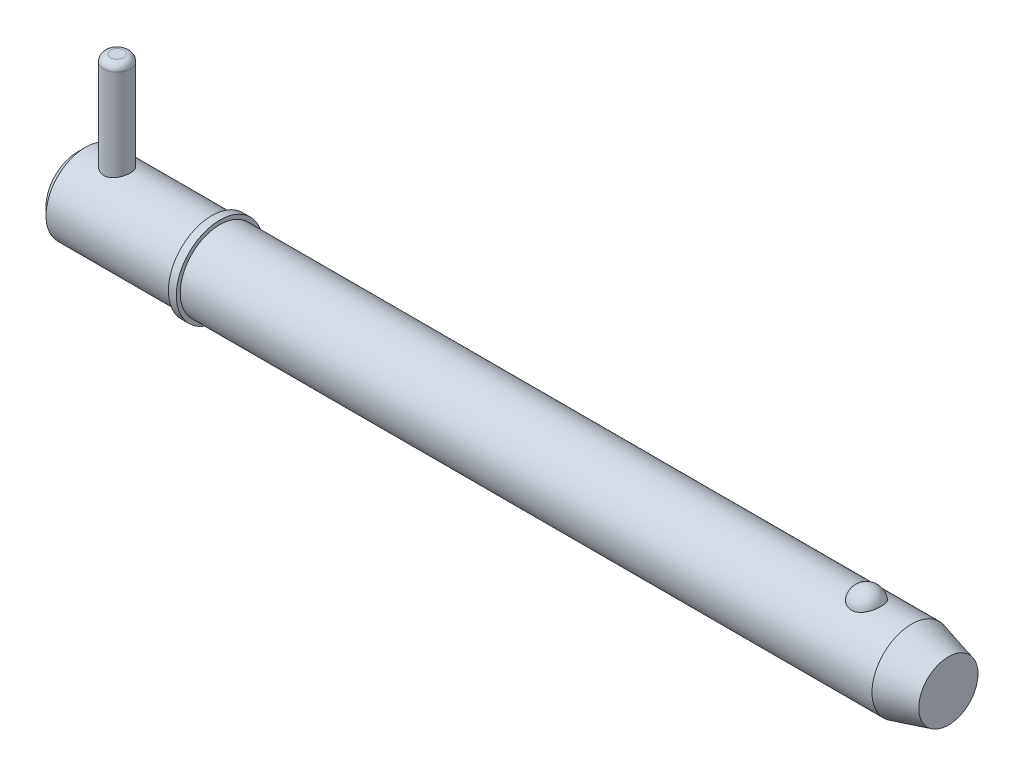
ISO-10303-21;
HEADER;
FILE_DESCRIPTION(('STEP AP214'),'2;1');
FILE_NAME('part.step','',(''),(''),'','','');
FILE_SCHEMA(('AUTOMOTIVE_DESIGN { 1 0 10303 214 1 1 1 1 }'));
ENDSEC;
DATA;
#1=APPLICATION_CONTEXT('core data for automotive mechanical design processes');
#2=APPLICATION_PROTOCOL_DEFINITION('international standard','automotive_design',2000,#1);
#3=PRODUCT_CONTEXT('',#1,'mechanical');
#4=PRODUCT('Part','Part','',(#3));
#5=PRODUCT_RELATED_PRODUCT_CATEGORY('part','',(#4));
#6=PRODUCT_DEFINITION_FORMATION('','',#4);
#7=PRODUCT_DEFINITION_CONTEXT('part definition',#1,'design');
#8=PRODUCT_DEFINITION('design','',#6,#7);
#9=PRODUCT_DEFINITION_SHAPE('','',#8);
#10=(LENGTH_UNIT() NAMED_UNIT(*) SI_UNIT(.MILLI.,.METRE.));
#11=(NAMED_UNIT(*) PLANE_ANGLE_UNIT() SI_UNIT($,.RADIAN.));
#12=(NAMED_UNIT(*) SI_UNIT($,.STERADIAN.) SOLID_ANGLE_UNIT());
#13=UNCERTAINTY_MEASURE_WITH_UNIT(LENGTH_MEASURE(1.E-05),#10,'distance_accuracy_value','');
#14=(GEOMETRIC_REPRESENTATION_CONTEXT(3) GLOBAL_UNCERTAINTY_ASSIGNED_CONTEXT((#13)) GLOBAL_UNIT_ASSIGNED_CONTEXT((#10,
#11,#12)) REPRESENTATION_CONTEXT('',''));
#15=CARTESIAN_POINT('',(0.,0.,0.));
#16=DIRECTION('',(0.,0.,1.));
#17=DIRECTION('',(1.,0.,0.));
#18=AXIS2_PLACEMENT_3D('',#15,#16,#17);
#19=CARTESIAN_POINT('',(7.14,24.605,0.));
#20=DIRECTION('',(0.,-1.,0.));
#21=DIRECTION('',(0.,0.,-1.));
#22=AXIS2_PLACEMENT_3D('',#19,#20,#21);
#23=CYLINDRICAL_SURFACE('',#22,2.38);
#24=CARTESIAN_POINT('',(7.14,-5.955,0.));
#25=DIRECTION('',(0.,1.,0.));
#26=DIRECTION('',(0.,0.,1.));
#27=AXIS2_PLACEMENT_3D('',#24,#25,#26);
#28=CIRCLE('',#27,2.38);
#29=CARTESIAN_POINT('',(7.14,-5.955,2.38));
#30=VERTEX_POINT('',#29);
#31=EDGE_CURVE('P0_E25',#30,#30,#28,.T.);
#32=ORIENTED_EDGE('',*,*,#31,.T.);
#33=EDGE_LOOP('',(#32));
#34=FACE_BOUND('',#33,.T.);
#35=CARTESIAN_POINT('',(7.14,23.415,0.));
#36=DIRECTION('',(0.,1.,0.));
#37=DIRECTION('',(0.,0.,1.));
#38=AXIS2_PLACEMENT_3D('',#35,#36,#37);
#39=CIRCLE('',#38,2.38);
#40=CARTESIAN_POINT('',(7.14,23.415,2.38));
#41=VERTEX_POINT('',#40);
#42=EDGE_CURVE('P0_E29',#41,#41,#39,.F.);
#43=ORIENTED_EDGE('',*,*,#42,.T.);
#44=EDGE_LOOP('',(#43));
#45=FACE_BOUND('',#44,.T.);
#46=ADVANCED_FACE('P0_F14',(#34,#45),#23,.T.);
#47=CARTESIAN_POINT('',(7.14,24.605,0.));
#48=DIRECTION('',(0.,1.,0.));
#49=DIRECTION('',(0.,0.,1.));
#50=AXIS2_PLACEMENT_3D('',#47,#48,#49);
#51=PLANE('',#50);
#52=CARTESIAN_POINT('',(7.14,24.605,0.));
#53=DIRECTION('',(0.,1.,0.));
#54=DIRECTION('',(0.,0.,1.));
#55=AXIS2_PLACEMENT_3D('',#52,#53,#54);
#56=CIRCLE('',#55,1.19);
#57=CARTESIAN_POINT('',(7.14,24.605,1.19));
#58=VERTEX_POINT('',#57);
#59=EDGE_CURVE('P0_E10',#58,#58,#56,.T.);
#60=ORIENTED_EDGE('',*,*,#59,.T.);
#61=EDGE_LOOP('',(#60));
#62=FACE_BOUND('',#61,.T.);
#63=ADVANCED_FACE('P0_F46',(#62),#51,.T.);
#64=CARTESIAN_POINT('',(7.14,-7.145,0.));
#65=DIRECTION('',(0.,1.,0.));
#66=DIRECTION('',(0.,0.,1.));
#67=AXIS2_PLACEMENT_3D('',#64,#65,#66);
#68=PLANE('',#67);
#69=CARTESIAN_POINT('',(7.14,-7.145,0.));
#70=DIRECTION('',(0.,1.,0.));
#71=DIRECTION('',(0.,0.,1.));
#72=AXIS2_PLACEMENT_3D('',#69,#70,#71);
#73=CIRCLE('',#72,1.19);
#74=CARTESIAN_POINT('',(7.14,-7.145,1.19));
#75=VERTEX_POINT('',#74);
#76=EDGE_CURVE('P0_E21',#75,#75,#73,.F.);
#77=ORIENTED_EDGE('',*,*,#76,.T.);
#78=EDGE_LOOP('',(#77));
#79=FACE_BOUND('',#78,.T.);
#80=ADVANCED_FACE('P0_F43',(#79),#68,.F.);
#81=CARTESIAN_POINT('',(7.14,-5.955,0.));
#82=DIRECTION('',(0.,1.,0.));
#83=DIRECTION('',(0.,0.,1.));
#84=AXIS2_PLACEMENT_3D('',#81,#82,#83);
#85=DEGENERATE_TOROIDAL_SURFACE('',#84,1.19,1.19,.T.);
#86=ORIENTED_EDGE('',*,*,#76,.F.);
#87=EDGE_LOOP('',(#86));
#88=FACE_BOUND('',#87,.T.);
#89=ORIENTED_EDGE('',*,*,#31,.F.);
#90=EDGE_LOOP('',(#89));
#91=FACE_BOUND('',#90,.T.);
#92=ADVANCED_FACE('P0_F38',(#88,#91),#85,.T.);
#93=CARTESIAN_POINT('',(7.14,23.415,0.));
#94=DIRECTION('',(0.,1.,0.));
#95=DIRECTION('',(0.,0.,1.));
#96=AXIS2_PLACEMENT_3D('',#93,#94,#95);
#97=DEGENERATE_TOROIDAL_SURFACE('',#96,1.19,1.19,.T.);
#98=ORIENTED_EDGE('',*,*,#42,.F.);
#99=EDGE_LOOP('',(#98));
#100=FACE_BOUND('',#99,.T.);
#101=ORIENTED_EDGE('',*,*,#59,.F.);
#102=EDGE_LOOP('',(#101));
#103=FACE_BOUND('',#102,.T.);
#104=ADVANCED_FACE('P0_F16',(#100,#103),#97,.T.);
#105=CLOSED_SHELL('',(#46,#63,#80,#92,#104));
#106=MANIFOLD_SOLID_BREP('P0_B1',#105);
#107=CARTESIAN_POINT('',(0.,0.,0.));
#108=DIRECTION('',(1.,0.,0.));
#109=DIRECTION('',(0.,0.,-1.));
#110=AXIS2_PLACEMENT_3D('',#107,#108,#109);
#111=CYLINDRICAL_SURFACE('',#110,7.145);
#112=CARTESIAN_POINT('',(150.78362424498,0.,0.));
#113=DIRECTION('',(1.,0.,0.));
#114=DIRECTION('',(0.,0.,-1.));
#115=AXIS2_PLACEMENT_3D('',#112,#113,#114);
#116=CIRCLE('',#115,7.145);
#117=CARTESIAN_POINT('',(150.78362424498,0.,-7.145));
#118=VERTEX_POINT('',#117);
#119=EDGE_CURVE('P1_E81',#118,#118,#116,.T.);
#120=ORIENTED_EDGE('',*,*,#119,.F.);
#121=EDGE_LOOP('',(#120));
#122=FACE_BOUND('',#121,.T.);
#123=CARTESIAN_POINT('',(25.7,0.,0.));
#124=DIRECTION('',(1.,0.,0.));
#125=DIRECTION('',(0.,0.,-1.));
#126=AXIS2_PLACEMENT_3D('',#123,#124,#125);
#127=CIRCLE('',#126,7.145);
#128=CARTESIAN_POINT('',(25.7,0.,-7.145));
#129=VERTEX_POINT('',#128);
#130=EDGE_CURVE('P1_E85',#129,#129,#127,.T.);
#131=ORIENTED_EDGE('',*,*,#130,.T.);
#132=EDGE_LOOP('',(#131));
#133=FACE_BOUND('',#132,.T.);
#134=CARTESIAN_POINT('',(142.639503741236,6.60328629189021,2.72903557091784));
#135=CARTESIAN_POINT('',(142.498315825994,6.60329644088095,2.7290249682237));
#136=CARTESIAN_POINT('',(142.356883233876,6.60799490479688,2.71772840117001));
#137=CARTESIAN_POINT('',(142.077955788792,6.62628236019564,2.6728193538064));
#138=CARTESIAN_POINT('',(141.940472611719,6.63989534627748,2.63914664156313));
#139=CARTESIAN_POINT('',(141.673889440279,6.67440775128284,2.55059642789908));
#140=CARTESIAN_POINT('',(141.544768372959,6.69528793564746,2.49577486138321));
#141=CARTESIAN_POINT('',(141.297869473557,6.74205585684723,2.36651799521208));
#142=CARTESIAN_POINT('',(141.180086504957,6.76794130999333,2.2920916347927));
#143=CARTESIAN_POINT('',(140.95516710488,6.82286177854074,2.12312937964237));
#144=CARTESIAN_POINT('',(140.848440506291,6.85196655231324,2.0280710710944));
#145=CARTESIAN_POINT('',(140.651918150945,6.90970232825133,1.82167822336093));
#146=CARTESIAN_POINT('',(140.562127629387,6.93833318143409,1.71033867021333));
#147=CARTESIAN_POINT('',(140.397667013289,6.9935167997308,1.46891951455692));
#148=CARTESIAN_POINT('',(140.323844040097,7.01992110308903,1.33822781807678));
#149=CARTESIAN_POINT('',(140.198088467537,7.06643385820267,1.06566567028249));
#150=CARTESIAN_POINT('',(140.14615735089,7.08654188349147,0.923794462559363));
#151=CARTESIAN_POINT('',(140.064732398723,7.11862399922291,0.630993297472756));
#152=CARTESIAN_POINT('',(140.035516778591,7.13049704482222,0.479974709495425));
#153=CARTESIAN_POINT('',(140.001174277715,7.14449484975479,0.174782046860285));
#154=CARTESIAN_POINT('',(139.996046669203,7.14661990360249,0.020608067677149));
#155=CARTESIAN_POINT('',(140.009938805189,7.14092465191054,-0.285506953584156));
#156=CARTESIAN_POINT('',(140.028810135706,7.1331654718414,-0.437455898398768));
#157=CARTESIAN_POINT('',(140.090062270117,7.10859076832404,-0.73577860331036));
#158=CARTESIAN_POINT('',(140.132443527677,7.0917750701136,-0.882152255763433));
#159=CARTESIAN_POINT('',(140.239934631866,7.05076716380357,-1.16543149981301));
#160=CARTESIAN_POINT('',(140.305075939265,7.02656475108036,-1.30232366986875));
#161=CARTESIAN_POINT('',(140.456759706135,6.97329145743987,-1.56265907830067));
#162=CARTESIAN_POINT('',(140.543303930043,6.94422017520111,-1.68610120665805));
#163=CARTESIAN_POINT('',(140.736465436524,6.88415108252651,-1.91671004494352));
#164=CARTESIAN_POINT('',(140.843180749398,6.85314438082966,-2.02379244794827));
#165=CARTESIAN_POINT('',(141.073974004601,6.79282069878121,-2.21787433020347));
#166=CARTESIAN_POINT('',(141.198050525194,6.76350358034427,-2.30487545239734));
#167=CARTESIAN_POINT('',(141.457678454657,6.71060580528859,-2.45458647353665));
#168=CARTESIAN_POINT('',(141.592938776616,6.68691885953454,-2.51776240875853));
#169=CARTESIAN_POINT('',(141.873277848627,6.64741247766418,-2.62030218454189));
#170=CARTESIAN_POINT('',(142.018352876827,6.63159007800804,-2.65967499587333));
#171=CARTESIAN_POINT('',(142.306347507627,6.61038594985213,-2.71193301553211));
#172=CARTESIAN_POINT('',(142.44900807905,6.60451880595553,-2.72605165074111));
#173=CARTESIAN_POINT('',(142.73480047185,6.60240611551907,-2.73116688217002));
#174=CARTESIAN_POINT('',(142.877932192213,6.60615862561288,-2.7221681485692));
#175=CARTESIAN_POINT('',(143.155848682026,6.62256094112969,-2.68200435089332));
#176=CARTESIAN_POINT('',(143.290754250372,6.63492533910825,-2.65154998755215));
#177=CARTESIAN_POINT('',(143.55332009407,6.66687445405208,-2.57015684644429));
#178=CARTESIAN_POINT('',(143.68097978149,6.68645975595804,-2.51921640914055));
#179=CARTESIAN_POINT('',(143.928577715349,6.73127274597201,-2.39693610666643));
#180=CARTESIAN_POINT('',(144.048287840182,6.7566138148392,-2.32517694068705));
#181=CARTESIAN_POINT('',(144.274159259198,6.81006003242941,-2.16363812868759));
#182=CARTESIAN_POINT('',(144.380317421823,6.83816581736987,-2.07385432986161));
#183=CARTESIAN_POINT('',(144.581862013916,6.89580469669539,-1.87357235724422));
#184=CARTESIAN_POINT('',(144.676440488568,6.92533863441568,-1.76226074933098));
#185=CARTESIAN_POINT('',(144.846332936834,6.98139526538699,-1.5251169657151));
#186=CARTESIAN_POINT('',(144.921643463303,7.0079174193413,-1.39928219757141));
#187=CARTESIAN_POINT('',(145.053595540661,7.05607625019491,-1.1321597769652));
#188=CARTESIAN_POINT('',(145.109568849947,7.07753119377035,-0.990508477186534));
#189=CARTESIAN_POINT('',(145.198296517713,7.11222355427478,-0.699154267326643));
#190=CARTESIAN_POINT('',(145.231050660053,7.12546089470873,-0.549451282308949));
#191=CARTESIAN_POINT('',(145.272689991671,7.14237584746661,-0.246120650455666));
#192=CARTESIAN_POINT('',(145.281558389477,7.14604673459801,-0.0924903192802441));
#193=CARTESIAN_POINT('',(145.275194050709,7.14343510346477,0.214181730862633));
#194=CARTESIAN_POINT('',(145.259961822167,7.13715279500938,0.367223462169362));
#195=CARTESIAN_POINT('',(145.205845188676,7.1153294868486,0.667595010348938));
#196=CARTESIAN_POINT('',(145.167077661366,7.09983424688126,0.814949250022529));
#197=CARTESIAN_POINT('',(145.066770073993,7.06119140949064,1.1006322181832));
#198=CARTESIAN_POINT('',(145.005228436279,7.03804328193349,1.23896032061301));
#199=CARTESIAN_POINT('',(144.860207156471,6.98632429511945,1.50352300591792));
#200=CARTESIAN_POINT('',(144.776606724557,6.95772382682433,1.62968561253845));
#201=CARTESIAN_POINT('',(144.58938046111,6.89823072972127,1.86554304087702));
#202=CARTESIAN_POINT('',(144.485755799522,6.86733823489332,1.97523882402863));
#203=CARTESIAN_POINT('',(144.261076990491,6.80676456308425,2.174822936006));
#204=CARTESIAN_POINT('',(144.140067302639,6.7770805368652,2.26476035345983));
#205=CARTESIAN_POINT('',(143.883340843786,6.7223050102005,2.42252989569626));
#206=CARTESIAN_POINT('',(143.74761851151,6.69721525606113,2.4903536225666));
#207=CARTESIAN_POINT('',(143.470402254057,6.65552591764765,2.59967646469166));
#208=CARTESIAN_POINT('',(143.329281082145,6.63865794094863,2.6420201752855));
#209=CARTESIAN_POINT('',(143.041444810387,6.61425039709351,2.70255841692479));
#210=CARTESIAN_POINT('',(142.894748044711,6.606682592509,2.72082606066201));
#211=CARTESIAN_POINT('',(142.711679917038,6.60358754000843,2.72830331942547));
#212=CARTESIAN_POINT('',(142.675599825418,6.60328369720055,2.72903828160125));
#213=CARTESIAN_POINT('',(142.639503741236,6.60328629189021,2.72903557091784));
#214=B_SPLINE_CURVE_WITH_KNOTS('',3,(#134,#135,#136,#137,#138,#139,#140,#141,#142,#143,#144,
#145,#146,#147,#148,#149,#150,#151,#152,#153,#154,#155,#156,#157,#158,#159,#160,#161,#162,#163,
#164,#165,#166,#167,#168,#169,#170,#171,#172,#173,#174,#175,#176,#177,#178,#179,#180,#181,#182,
#183,#184,#185,#186,#187,#188,#189,#190,#191,#192,#193,#194,#195,#196,#197,#198,#199,#200,#201,
#202,#203,#204,#205,#206,#207,#208,#209,#210,#211,#212,#213),.UNSPECIFIED.,.T.,.F.,(4,2,2,2,2,2,
2,2,2,2,2,2,2,2,2,2,2,2,2,2,2,2,2,2,2,2,2,2,2,2,2,2,2,2,2,2,2,2,2,4),(0.,0.423468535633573,
0.848081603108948,1.27157926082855,1.69488414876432,2.13051395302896,2.56627819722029,
3.02136706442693,3.47648674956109,3.93709649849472,4.39769233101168,4.85545355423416,
5.31322361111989,5.77162895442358,6.23007210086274,6.69080337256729,7.15149693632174,
7.60264329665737,8.05361952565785,8.48189729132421,8.91008854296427,9.32472524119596,
9.73939553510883,10.1630783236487,10.5868588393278,11.0319070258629,11.4770347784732,
11.9362874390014,12.3955443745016,12.8551240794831,13.3146940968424,13.7720003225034,
14.2293382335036,14.6892343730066,15.1491036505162,15.6078171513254,16.0667046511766,
16.5093965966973,16.9507410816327,17.0590049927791),.UNSPECIFIED.);
#215=CARTESIAN_POINT('',(142.639503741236,6.60328629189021,2.72903557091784));
#216=VERTEX_POINT('',#215);
#217=EDGE_CURVE('P1_E35',#216,#216,#214,.T.);
#218=ORIENTED_EDGE('',*,*,#217,.T.);
#219=EDGE_LOOP('',(#218));
#220=FACE_BOUND('',#219,.T.);
#221=ADVANCED_FACE('P1_F13',(#122,#133,#220),#111,.T.);
#222=CARTESIAN_POINT('',(0.,0.,0.));
#223=DIRECTION('',(-1.,0.,0.));
#224=DIRECTION('',(0.,0.,1.));
#225=AXIS2_PLACEMENT_3D('',#222,#223,#224);
#226=PLANE('',#225);
#227=CARTESIAN_POINT('',(0.,0.,0.));
#228=DIRECTION('',(1.,0.,0.));
#229=DIRECTION('',(0.,0.,-1.));
#230=AXIS2_PLACEMENT_3D('',#227,#228,#229);
#231=CIRCLE('',#230,5.716);
#232=CARTESIAN_POINT('',(0.,0.,-5.716));
#233=VERTEX_POINT('',#232);
#234=EDGE_CURVE('P1_E9',#233,#233,#231,.T.);
#235=ORIENTED_EDGE('',*,*,#234,.F.);
#236=EDGE_LOOP('',(#235));
#237=FACE_BOUND('',#236,.T.);
#238=ADVANCED_FACE('P1_F15',(#237),#226,.T.);
#239=CARTESIAN_POINT('',(1.42899999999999,0.,0.));
#240=DIRECTION('',(1.,0.,0.));
#241=DIRECTION('',(0.,0.,-1.));
#242=AXIS2_PLACEMENT_3D('',#239,#240,#241);
#243=CONICAL_SURFACE('',#242,7.145,0.78539816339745);
#244=ORIENTED_EDGE('',*,*,#234,.T.);
#245=EDGE_LOOP('',(#244));
#246=FACE_BOUND('',#245,.T.);
#247=CARTESIAN_POINT('',(1.42899999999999,0.,0.));
#248=DIRECTION('',(1.,0.,0.));
#249=DIRECTION('',(0.,0.,-1.));
#250=AXIS2_PLACEMENT_3D('',#247,#248,#249);
#251=CIRCLE('',#250,7.145);
#252=CARTESIAN_POINT('',(1.42899999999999,0.,-7.145));
#253=VERTEX_POINT('',#252);
#254=EDGE_CURVE('P1_E26',#253,#253,#251,.T.);
#255=ORIENTED_EDGE('',*,*,#254,.F.);
#256=EDGE_LOOP('',(#255));
#257=FACE_BOUND('',#256,.T.);
#258=ADVANCED_FACE('P1_F77',(#246,#257),#243,.T.);
#259=CARTESIAN_POINT('',(0.,0.,0.));
#260=DIRECTION('',(1.,0.,0.));
#261=DIRECTION('',(0.,0.,-1.));
#262=AXIS2_PLACEMENT_3D('',#259,#260,#261);
#263=CYLINDRICAL_SURFACE('',#262,7.145);
#264=CARTESIAN_POINT('',(7.14,-6.73695962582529,2.38));
#265=CARTESIAN_POINT('',(7.01035997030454,-6.73695921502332,2.38000059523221));
#266=CARTESIAN_POINT('',(6.88072348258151,-6.74074253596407,2.36937183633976));
#267=CARTESIAN_POINT('',(6.62529075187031,-6.75538853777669,2.32728080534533));
#268=CARTESIAN_POINT('',(6.49949514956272,-6.76625239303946,2.29581507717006));
#269=CARTESIAN_POINT('',(6.2554858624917,-6.79369535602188,2.21327763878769));
#270=CARTESIAN_POINT('',(6.13725786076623,-6.81026326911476,2.16224430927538));
#271=CARTESIAN_POINT('',(5.91100349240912,-6.84723128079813,2.04215132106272));
#272=CARTESIAN_POINT('',(5.80297937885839,-6.86763222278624,1.97308769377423));
#273=CARTESIAN_POINT('',(5.59597854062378,-6.91086152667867,1.81600414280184));
#274=CARTESIAN_POINT('',(5.49745861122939,-6.93375032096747,1.72739874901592));
#275=CARTESIAN_POINT('',(5.31636508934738,-6.97886546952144,1.53499636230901));
#276=CARTESIAN_POINT('',(5.23379405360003,-7.00109171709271,1.43119693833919));
#277=CARTESIAN_POINT('',(5.08487013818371,-7.04307708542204,1.20801318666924));
#278=CARTESIAN_POINT('',(5.01899578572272,-7.06275685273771,1.08829330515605));
#279=CARTESIAN_POINT('',(4.90850130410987,-7.09671988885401,0.838703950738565));
#280=CARTESIAN_POINT('',(4.86387545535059,-7.11100460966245,0.70883722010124));
#281=CARTESIAN_POINT('',(4.79869354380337,-7.13213998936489,0.44742990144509));
#282=CARTESIAN_POINT('',(4.77735497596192,-7.13923172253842,0.316104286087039));
#283=CARTESIAN_POINT('',(4.75686536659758,-7.14603777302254,0.0515578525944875));
#284=CARTESIAN_POINT('',(4.75770861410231,-7.14575398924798,-0.0816624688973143));
#285=CARTESIAN_POINT('',(4.78106216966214,-7.13800438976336,-0.340678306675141));
#286=CARTESIAN_POINT('',(4.80272255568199,-7.13082030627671,-0.466560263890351));
#287=CARTESIAN_POINT('',(4.86569013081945,-7.11043095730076,-0.712788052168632));
#288=CARTESIAN_POINT('',(4.90699865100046,-7.09722528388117,-0.833133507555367));
#289=CARTESIAN_POINT('',(5.00858673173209,-7.06591754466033,-1.06673173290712));
#290=CARTESIAN_POINT('',(5.06910834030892,-7.0477534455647,-1.17987058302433));
#291=CARTESIAN_POINT('',(5.20720514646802,-7.00841977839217,-1.39463797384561));
#292=CARTESIAN_POINT('',(5.28478508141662,-6.987249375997,-1.49626330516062));
#293=CARTESIAN_POINT('',(5.4590800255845,-6.94296010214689,-1.69017445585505));
#294=CARTESIAN_POINT('',(5.55652324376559,-6.91979641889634,-1.78179645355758));
#295=CARTESIAN_POINT('',(5.76558873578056,-6.87497076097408,-1.94761348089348));
#296=CARTESIAN_POINT('',(5.87721318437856,-6.85330901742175,-2.02180583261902));
#297=CARTESIAN_POINT('',(6.11357367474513,-6.81369485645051,-2.15157488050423));
#298=CARTESIAN_POINT('',(6.23847358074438,-6.79579956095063,-2.20687188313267));
#299=CARTESIAN_POINT('',(6.49655785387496,-6.76640630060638,-2.29542443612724));
#300=CARTESIAN_POINT('',(6.62973872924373,-6.75490565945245,-2.32868920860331));
#301=CARTESIAN_POINT('',(6.89417536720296,-6.74020933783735,-2.37088225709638));
#302=CARTESIAN_POINT('',(7.02524746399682,-6.73666278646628,-2.38083959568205));
#303=CARTESIAN_POINT('',(7.28721035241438,-6.73729555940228,-2.37904974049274));
#304=CARTESIAN_POINT('',(7.41810117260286,-6.7414734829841,-2.36730648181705));
#305=CARTESIAN_POINT('',(7.67130717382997,-6.75673471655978,-2.32337336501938));
#306=CARTESIAN_POINT('',(7.79376251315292,-6.76757635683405,-2.29189834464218));
#307=CARTESIAN_POINT('',(8.03162917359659,-6.79467771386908,-2.21025275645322));
#308=CARTESIAN_POINT('',(8.14703924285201,-6.8109383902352,-2.16007887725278));
#309=CARTESIAN_POINT('',(8.37159169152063,-6.84768362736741,-2.04065289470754));
#310=CARTESIAN_POINT('',(8.48041962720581,-6.86828569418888,-1.97084668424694));
#311=CARTESIAN_POINT('',(8.68518919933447,-6.91116416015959,-1.8147657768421));
#312=CARTESIAN_POINT('',(8.78112702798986,-6.93344105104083,-1.72848623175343));
#313=CARTESIAN_POINT('',(8.96215574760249,-6.97845348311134,-1.53698616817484));
#314=CARTESIAN_POINT('',(9.04650427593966,-7.00115965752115,-1.43105491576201));
#315=CARTESIAN_POINT('',(9.19627592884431,-7.04341676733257,-1.20598377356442));
#316=CARTESIAN_POINT('',(9.26169972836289,-7.06296781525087,-1.08684435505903));
#317=CARTESIAN_POINT('',(9.37116617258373,-7.0966205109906,-0.83933303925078));
#318=CARTESIAN_POINT('',(9.41534821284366,-7.11075755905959,-0.711027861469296));
#319=CARTESIAN_POINT('',(9.48132660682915,-7.13214194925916,-0.448245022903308));
#320=CARTESIAN_POINT('',(9.50313102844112,-7.13939177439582,-0.313769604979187));
#321=CARTESIAN_POINT('',(9.5230098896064,-7.14599771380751,-0.049254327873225));
#322=CARTESIAN_POINT('',(9.52215013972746,-7.14570837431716,0.0806974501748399));
#323=CARTESIAN_POINT('',(9.49935359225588,-7.13814116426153,0.338518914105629));
#324=CARTESIAN_POINT('',(9.47741850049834,-7.13086385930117,0.466388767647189));
#325=CARTESIAN_POINT('',(9.4138005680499,-7.11026814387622,0.714400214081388));
#326=CARTESIAN_POINT('',(9.37243609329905,-7.09704726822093,0.834632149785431));
#327=CARTESIAN_POINT('',(9.27142829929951,-7.06592602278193,1.06649582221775));
#328=CARTESIAN_POINT('',(9.2117816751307,-7.04802480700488,1.1781259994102));
#329=CARTESIAN_POINT('',(9.07336776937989,-7.00856499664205,1.39411030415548));
#330=CARTESIAN_POINT('',(8.99397590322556,-6.98689577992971,1.49804368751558));
#331=CARTESIAN_POINT('',(8.81938810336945,-6.9426110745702,1.69146078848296));
#332=CARTESIAN_POINT('',(8.72418713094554,-6.91999528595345,1.78093988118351));
#333=CARTESIAN_POINT('',(8.51623540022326,-6.87531507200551,1.94646188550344));
#334=CARTESIAN_POINT('',(8.4029442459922,-6.85330672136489,2.02184316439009));
#335=CARTESIAN_POINT('',(8.16461714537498,-6.81342065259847,2.1524427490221));
#336=CARTESIAN_POINT('',(8.03958429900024,-6.7955418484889,2.20766635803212));
#337=CARTESIAN_POINT('',(7.78712566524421,-6.76686117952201,2.29403636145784));
#338=CARTESIAN_POINT('',(7.66006989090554,-6.75577342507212,2.32616709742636));
#339=CARTESIAN_POINT('',(7.40200728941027,-6.74082409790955,2.36914495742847));
#340=CARTESIAN_POINT('',(7.27100183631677,-6.73696004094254,2.37999939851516));
#341=CARTESIAN_POINT('',(7.14,-6.73695962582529,2.38));
#342=B_SPLINE_CURVE_WITH_KNOTS('',3,(#264,#265,#266,#267,#268,#269,#270,#271,#272,#273,#274,
#275,#276,#277,#278,#279,#280,#281,#282,#283,#284,#285,#286,#287,#288,#289,#290,#291,#292,#293,
#294,#295,#296,#297,#298,#299,#300,#301,#302,#303,#304,#305,#306,#307,#308,#309,#310,#311,#312,
#313,#314,#315,#316,#317,#318,#319,#320,#321,#322,#323,#324,#325,#326,#327,#328,#329,#330,#331,
#332,#333,#334,#335,#336,#337,#338,#339,#340,#341),.UNSPECIFIED.,.T.,.F.,(4,2,2,2,2,2,2,2,2,2,2,
2,2,2,2,2,2,2,2,2,2,2,2,2,2,2,2,2,2,2,2,2,2,2,2,2,2,2,4),(0.,0.388434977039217,
0.776934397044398,1.16467566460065,1.55250234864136,1.9540847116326,2.35573139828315,
2.76784120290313,3.17984001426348,3.57752248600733,3.97510257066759,4.35711073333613,
4.7391447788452,5.12619663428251,5.51335611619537,5.91871976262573,6.3241456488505,
6.73533623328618,7.14635459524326,7.53885245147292,7.93127914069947,8.31025106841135,
8.68929014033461,9.08033871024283,9.47150254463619,9.88145528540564,10.2913934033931,
10.6986033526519,11.1056664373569,11.4936225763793,11.8815473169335,12.2633262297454,
12.645174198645,13.0411187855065,13.437189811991,13.8487371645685,14.2601761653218,
14.6528265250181,15.0453418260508),.UNSPECIFIED.);
#343=CARTESIAN_POINT('',(7.14,-6.73695962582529,2.38));
#344=VERTEX_POINT('',#343);
#345=EDGE_CURVE('P1_E17',#344,#344,#342,.T.);
#346=ORIENTED_EDGE('',*,*,#345,.F.);
#347=EDGE_LOOP('',(#346));
#348=FACE_BOUND('',#347,.T.);
#349=CARTESIAN_POINT('',(7.14,6.73695962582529,2.38));
#350=CARTESIAN_POINT('',(7.26964002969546,6.73695921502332,2.38000059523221));
#351=CARTESIAN_POINT('',(7.39927651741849,6.74074253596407,2.36937183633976));
#352=CARTESIAN_POINT('',(7.65470924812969,6.75538853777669,2.32728080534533));
#353=CARTESIAN_POINT('',(7.78050485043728,6.76625239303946,2.29581507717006));
#354=CARTESIAN_POINT('',(8.02451413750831,6.79369535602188,2.21327763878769));
#355=CARTESIAN_POINT('',(8.14274213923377,6.81026326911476,2.16224430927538));
#356=CARTESIAN_POINT('',(8.36899650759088,6.84723128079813,2.04215132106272));
#357=CARTESIAN_POINT('',(8.47702062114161,6.86763222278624,1.97308769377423));
#358=CARTESIAN_POINT('',(8.68402145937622,6.91086152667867,1.81600414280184));
#359=CARTESIAN_POINT('',(8.78254138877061,6.93375032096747,1.72739874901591));
#360=CARTESIAN_POINT('',(8.96363491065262,6.97886546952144,1.53499636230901));
#361=CARTESIAN_POINT('',(9.04620594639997,7.00109171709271,1.43119693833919));
#362=CARTESIAN_POINT('',(9.19512986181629,7.04307708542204,1.20801318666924));
#363=CARTESIAN_POINT('',(9.26100421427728,7.06275685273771,1.08829330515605));
#364=CARTESIAN_POINT('',(9.37149869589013,7.09671988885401,0.838703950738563));
#365=CARTESIAN_POINT('',(9.41612454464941,7.11100460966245,0.708837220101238));
#366=CARTESIAN_POINT('',(9.48130645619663,7.13213998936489,0.447429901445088));
#367=CARTESIAN_POINT('',(9.50264502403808,7.13923172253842,0.316104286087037));
#368=CARTESIAN_POINT('',(9.52313463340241,7.14603777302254,0.0515578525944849));
#369=CARTESIAN_POINT('',(9.52229138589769,7.14575398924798,-0.0816624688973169));
#370=CARTESIAN_POINT('',(9.49893783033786,7.13800438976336,-0.340678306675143));
#371=CARTESIAN_POINT('',(9.47727744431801,7.13082030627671,-0.466560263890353));
#372=CARTESIAN_POINT('',(9.41430986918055,7.11043095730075,-0.712788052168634));
#373=CARTESIAN_POINT('',(9.37300134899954,7.09722528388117,-0.833133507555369));
#374=CARTESIAN_POINT('',(9.27141326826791,7.06591754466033,-1.06673173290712));
#375=CARTESIAN_POINT('',(9.21089165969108,7.0477534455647,-1.17987058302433));
#376=CARTESIAN_POINT('',(9.07279485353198,7.00841977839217,-1.39463797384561));
#377=CARTESIAN_POINT('',(8.99521491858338,6.987249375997,-1.49626330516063));
#378=CARTESIAN_POINT('',(8.82091997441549,6.94296010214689,-1.69017445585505));
#379=CARTESIAN_POINT('',(8.72347675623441,6.91979641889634,-1.78179645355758));
#380=CARTESIAN_POINT('',(8.51441126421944,6.87497076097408,-1.94761348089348));
#381=CARTESIAN_POINT('',(8.40278681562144,6.85330901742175,-2.02180583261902));
#382=CARTESIAN_POINT('',(8.16642632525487,6.81369485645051,-2.15157488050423));
#383=CARTESIAN_POINT('',(8.04152641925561,6.79579956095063,-2.20687188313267));
#384=CARTESIAN_POINT('',(7.78344214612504,6.76640630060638,-2.29542443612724));
#385=CARTESIAN_POINT('',(7.65026127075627,6.75490565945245,-2.32868920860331));
#386=CARTESIAN_POINT('',(7.38582463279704,6.74020933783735,-2.37088225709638));
#387=CARTESIAN_POINT('',(7.25475253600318,6.73666278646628,-2.38083959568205));
#388=CARTESIAN_POINT('',(6.99278964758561,6.73729555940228,-2.37904974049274));
#389=CARTESIAN_POINT('',(6.86189882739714,6.7414734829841,-2.36730648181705));
#390=CARTESIAN_POINT('',(6.60869282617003,6.75673471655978,-2.32337336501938));
#391=CARTESIAN_POINT('',(6.48623748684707,6.76757635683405,-2.29189834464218));
#392=CARTESIAN_POINT('',(6.2483708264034,6.79467771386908,-2.21025275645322));
#393=CARTESIAN_POINT('',(6.13296075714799,6.8109383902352,-2.16007887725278));
#394=CARTESIAN_POINT('',(5.90840830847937,6.84768362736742,-2.04065289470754));
#395=CARTESIAN_POINT('',(5.79958037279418,6.86828569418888,-1.97084668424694));
#396=CARTESIAN_POINT('',(5.59481080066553,6.91116416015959,-1.8147657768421));
#397=CARTESIAN_POINT('',(5.49887297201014,6.93344105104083,-1.72848623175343));
#398=CARTESIAN_POINT('',(5.31784425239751,6.97845348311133,-1.53698616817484));
#399=CARTESIAN_POINT('',(5.23349572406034,7.00115965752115,-1.43105491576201));
#400=CARTESIAN_POINT('',(5.08372407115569,7.04341676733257,-1.20598377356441));
#401=CARTESIAN_POINT('',(5.01830027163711,7.06296781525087,-1.08684435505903));
#402=CARTESIAN_POINT('',(4.90883382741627,7.0966205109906,-0.839333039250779));
#403=CARTESIAN_POINT('',(4.86465178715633,7.11075755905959,-0.711027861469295));
#404=CARTESIAN_POINT('',(4.79867339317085,7.13214194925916,-0.448245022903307));
#405=CARTESIAN_POINT('',(4.77686897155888,7.13939177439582,-0.313769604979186));
#406=CARTESIAN_POINT('',(4.7569901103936,7.14599771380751,-0.0492543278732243));
#407=CARTESIAN_POINT('',(4.75784986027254,7.14570837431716,0.0806974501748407));
#408=CARTESIAN_POINT('',(4.78064640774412,7.13814116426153,0.33851891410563));
#409=CARTESIAN_POINT('',(4.80258149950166,7.13086385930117,0.46638876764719));
#410=CARTESIAN_POINT('',(4.8661994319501,7.11026814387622,0.714400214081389));
#411=CARTESIAN_POINT('',(4.90756390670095,7.09704726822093,0.834632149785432));
#412=CARTESIAN_POINT('',(5.00857170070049,7.06592602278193,1.06649582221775));
#413=CARTESIAN_POINT('',(5.0682183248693,7.04802480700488,1.1781259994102));
#414=CARTESIAN_POINT('',(5.20663223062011,7.00856499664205,1.39411030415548));
#415=CARTESIAN_POINT('',(5.28602409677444,6.98689577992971,1.49804368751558));
#416=CARTESIAN_POINT('',(5.46061189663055,6.9426110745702,1.69146078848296));
#417=CARTESIAN_POINT('',(5.55581286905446,6.91999528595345,1.78093988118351));
#418=CARTESIAN_POINT('',(5.76376459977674,6.87531507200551,1.94646188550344));
#419=CARTESIAN_POINT('',(5.8770557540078,6.85330672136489,2.02184316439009));
#420=CARTESIAN_POINT('',(6.11538285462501,6.81342065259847,2.1524427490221));
#421=CARTESIAN_POINT('',(6.24041570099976,6.7955418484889,2.20766635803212));
#422=CARTESIAN_POINT('',(6.4928743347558,6.76686117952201,2.29403636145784));
#423=CARTESIAN_POINT('',(6.61993010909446,6.75577342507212,2.32616709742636));
#424=CARTESIAN_POINT('',(6.87799271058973,6.74082409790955,2.36914495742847));
#425=CARTESIAN_POINT('',(7.00899816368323,6.73696004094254,2.37999939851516));
#426=CARTESIAN_POINT('',(7.14,6.73695962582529,2.38));
#427=B_SPLINE_CURVE_WITH_KNOTS('',3,(#349,#350,#351,#352,#353,#354,#355,#356,#357,#358,#359,
#360,#361,#362,#363,#364,#365,#366,#367,#368,#369,#370,#371,#372,#373,#374,#375,#376,#377,#378,
#379,#380,#381,#382,#383,#384,#385,#386,#387,#388,#389,#390,#391,#392,#393,#394,#395,#396,#397,
#398,#399,#400,#401,#402,#403,#404,#405,#406,#407,#408,#409,#410,#411,#412,#413,#414,#415,#416,
#417,#418,#419,#420,#421,#422,#423,#424,#425,#426),.UNSPECIFIED.,.T.,.F.,(4,2,2,2,2,2,2,2,2,2,2,
2,2,2,2,2,2,2,2,2,2,2,2,2,2,2,2,2,2,2,2,2,2,2,2,2,2,2,4),(0.,0.388434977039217,
0.776934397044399,1.16467566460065,1.55250234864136,1.9540847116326,2.35573139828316,
2.76784120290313,3.17984001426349,3.57752248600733,3.97510257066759,4.35711073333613,
4.73914477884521,5.12619663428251,5.51335611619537,5.91871976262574,6.3241456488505,
6.73533623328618,7.14635459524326,7.53885245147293,7.93127914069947,8.31025106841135,
8.68929014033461,9.08033871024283,9.47150254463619,9.88145528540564,10.2913934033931,
10.6986033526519,11.1056664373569,11.4936225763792,11.8815473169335,12.2633262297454,
12.645174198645,13.0411187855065,13.437189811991,13.8487371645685,14.2601761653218,
14.6528265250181,15.0453418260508),.UNSPECIFIED.);
#428=CARTESIAN_POINT('',(7.14,6.73695962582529,2.38));
#429=VERTEX_POINT('',#428);
#430=EDGE_CURVE('P1_E43',#429,#429,#427,.T.);
#431=ORIENTED_EDGE('',*,*,#430,.F.);
#432=EDGE_LOOP('',(#431));
#433=FACE_BOUND('',#432,.T.);
#434=ORIENTED_EDGE('',*,*,#254,.T.);
#435=EDGE_LOOP('',(#434));
#436=FACE_BOUND('',#435,.T.);
#437=CARTESIAN_POINT('',(24.271,0.,0.));
#438=DIRECTION('',(1.,0.,0.));
#439=DIRECTION('',(0.,0.,-1.));
#440=AXIS2_PLACEMENT_3D('',#437,#438,#439);
#441=CIRCLE('',#440,7.145);
#442=CARTESIAN_POINT('',(24.271,0.,-7.145));
#443=VERTEX_POINT('',#442);
#444=EDGE_CURVE('P1_E31',#443,#443,#441,.T.);
#445=ORIENTED_EDGE('',*,*,#444,.F.);
#446=EDGE_LOOP('',(#445));
#447=FACE_BOUND('',#446,.T.);
#448=ADVANCED_FACE('P1_F103',(#348,#433,#436,#447),#263,.T.);
#449=CARTESIAN_POINT('',(24.271,7.145,0.));
#450=DIRECTION('',(-1.,0.,0.));
#451=DIRECTION('',(0.,0.,1.));
#452=AXIS2_PLACEMENT_3D('',#449,#450,#451);
#453=PLANE('',#452);
#454=ORIENTED_EDGE('',*,*,#444,.T.);
#455=EDGE_LOOP('',(#454));
#456=FACE_BOUND('',#455,.T.);
#457=CARTESIAN_POINT('',(24.271,0.,0.));
#458=DIRECTION('',(1.,0.,0.));
#459=DIRECTION('',(0.,0.,-1.));
#460=AXIS2_PLACEMENT_3D('',#457,#458,#459);
#461=CIRCLE('',#460,7.8595);
#462=CARTESIAN_POINT('',(24.271,0.,-7.8595));
#463=VERTEX_POINT('',#462);
#464=EDGE_CURVE('P1_E91',#463,#463,#461,.T.);
#465=ORIENTED_EDGE('',*,*,#464,.F.);
#466=EDGE_LOOP('',(#465));
#467=FACE_BOUND('',#466,.T.);
#468=ADVANCED_FACE('P1_F100',(#456,#467),#453,.T.);
#469=CARTESIAN_POINT('',(0.,0.,0.));
#470=DIRECTION('',(1.,0.,0.));
#471=DIRECTION('',(0.,0.,-1.));
#472=AXIS2_PLACEMENT_3D('',#469,#470,#471);
#473=CYLINDRICAL_SURFACE('',#472,7.8595);
#474=ORIENTED_EDGE('',*,*,#464,.T.);
#475=EDGE_LOOP('',(#474));
#476=FACE_BOUND('',#475,.T.);
#477=CARTESIAN_POINT('',(25.7,0.,0.));
#478=DIRECTION('',(1.,0.,0.));
#479=DIRECTION('',(0.,0.,-1.));
#480=AXIS2_PLACEMENT_3D('',#477,#478,#479);
#481=CIRCLE('',#480,7.8595);
#482=CARTESIAN_POINT('',(25.7,0.,-7.8595));
#483=VERTEX_POINT('',#482);
#484=EDGE_CURVE('P1_E88',#483,#483,#481,.T.);
#485=ORIENTED_EDGE('',*,*,#484,.F.);
#486=EDGE_LOOP('',(#485));
#487=FACE_BOUND('',#486,.T.);
#488=ADVANCED_FACE('P1_F68',(#476,#487),#473,.T.);
#489=CARTESIAN_POINT('',(25.7,7.8595,0.));
#490=DIRECTION('',(1.,0.,0.));
#491=DIRECTION('',(0.,0.,-1.));
#492=AXIS2_PLACEMENT_3D('',#489,#490,#491);
#493=PLANE('',#492);
#494=ORIENTED_EDGE('',*,*,#484,.T.);
#495=EDGE_LOOP('',(#494));
#496=FACE_BOUND('',#495,.T.);
#497=ORIENTED_EDGE('',*,*,#130,.F.);
#498=EDGE_LOOP('',(#497));
#499=FACE_BOUND('',#498,.T.);
#500=ADVANCED_FACE('P1_F62',(#496,#499),#493,.T.);
#501=CARTESIAN_POINT('',(157.45,0.,0.));
#502=DIRECTION('',(-1.,0.,0.));
#503=DIRECTION('',(0.,0.,1.));
#504=AXIS2_PLACEMENT_3D('',#501,#502,#503);
#505=CONICAL_SURFACE('',#504,5.35875000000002,0.26179938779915);
#506=ORIENTED_EDGE('',*,*,#119,.T.);
#507=EDGE_LOOP('',(#506));
#508=FACE_BOUND('',#507,.T.);
#509=CARTESIAN_POINT('',(157.45,0.,0.));
#510=DIRECTION('',(1.,0.,0.));
#511=DIRECTION('',(0.,0.,-1.));
#512=AXIS2_PLACEMENT_3D('',#509,#510,#511);
#513=CIRCLE('',#512,5.35875000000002);
#514=CARTESIAN_POINT('',(157.45,0.,-5.35875000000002));
#515=VERTEX_POINT('',#514);
#516=EDGE_CURVE('P1_E42',#515,#515,#513,.T.);
#517=ORIENTED_EDGE('',*,*,#516,.F.);
#518=EDGE_LOOP('',(#517));
#519=FACE_BOUND('',#518,.T.);
#520=ADVANCED_FACE('P1_F59',(#508,#519),#505,.T.);
#521=CARTESIAN_POINT('',(157.45,5.35875000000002,0.));
#522=DIRECTION('',(1.,0.,0.));
#523=DIRECTION('',(0.,0.,-1.));
#524=AXIS2_PLACEMENT_3D('',#521,#522,#523);
#525=PLANE('',#524);
#526=ORIENTED_EDGE('',*,*,#516,.T.);
#527=EDGE_LOOP('',(#526));
#528=FACE_BOUND('',#527,.T.);
#529=ADVANCED_FACE('P1_F55',(#528),#525,.T.);
#530=CARTESIAN_POINT('',(142.639503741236,6.4305,0.));
#531=DIRECTION('',(-1.,0.,0.));
#532=DIRECTION('',(0.,-1.,0.));
#533=AXIS2_PLACEMENT_3D('',#530,#531,#532);
#534=SPHERICAL_SURFACE('',#533,2.7345);
#535=ORIENTED_EDGE('',*,*,#217,.F.);
#536=EDGE_LOOP('',(#535));
#537=FACE_BOUND('',#536,.T.);
#538=ADVANCED_FACE('P1_F50',(#537),#534,.T.);
#539=CARTESIAN_POINT('',(7.14,-7.8595,0.));
#540=DIRECTION('',(0.,1.,0.));
#541=DIRECTION('',(0.,0.,1.));
#542=AXIS2_PLACEMENT_3D('',#539,#540,#541);
#543=CYLINDRICAL_SURFACE('',#542,2.38);
#544=ORIENTED_EDGE('',*,*,#345,.T.);
#545=EDGE_LOOP('',(#544));
#546=FACE_BOUND('',#545,.T.);
#547=ORIENTED_EDGE('',*,*,#430,.T.);
#548=EDGE_LOOP('',(#547));
#549=FACE_BOUND('',#548,.T.);
#550=ADVANCED_FACE('P1_F54',(#546,#549),#543,.F.);
#551=CLOSED_SHELL('',(#221,#238,#258,#448,#468,#488,#500,#520,#529,#538,#550));
#552=MANIFOLD_SOLID_BREP('P1_B1',#551);
#553=ADVANCED_BREP_SHAPE_REPRESENTATION('',(#18,#106,#552),#14);
#554=SHAPE_DEFINITION_REPRESENTATION(#9,#553);
ENDSEC;
END-ISO-10303-21;
